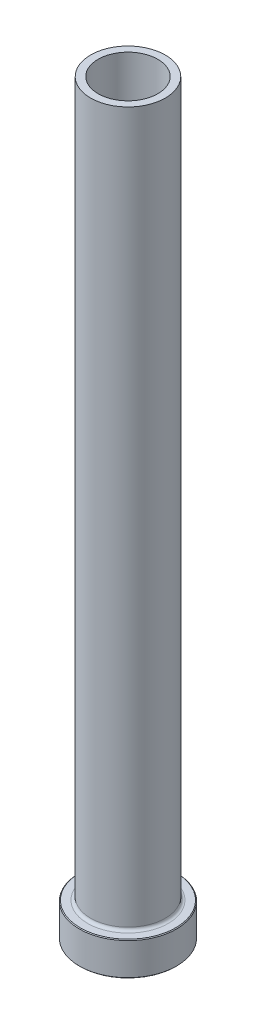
from build123d import *

# Parameters (mm, degrees)
FILLET1_R     = 0.8
CHAMFER1_SIZE = 0.2
CHAMFER3_SIZE = 0.5


with BuildPart() as part:
    # Sketch1 → Revolve1 (revolve)
    with BuildSketch(Plane.XY, mode=Mode.PRIVATE) as revolve1_sk:
        Polygon((-8, 200), (-10, 200), (-10, 9), (-13, 9), (-13, 0), (-8.25, 0), (-8.25, 133), (-8, 145), align=None)
    revolve(revolve1_sk.sketch.rotate(Axis((0, 92.187680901, 0), (0, -1, 0)), 270), axis=Axis((0, 92.187680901, 0), (0, -1, 0)))

    # Fillet1
    fillet1_edges = [part.edges().sort_by_distance(p)[0] for p in [
        (0, 9, -10),
    ]]
    fillet(fillet1_edges, radius=FILLET1_R)

    # Chamfer1
    chamfer1_edges = [part.edges().sort_by_distance(p)[0] for p in [
        (0, 0, -13),
        (0, 9, -13),
    ]]
    chamfer(chamfer1_edges, length=CHAMFER1_SIZE)

    # Chamfer3
    chamfer3_edges = [part.edges().sort_by_distance(p)[0] for p in [
        (0, 0, -8.25),
    ]]
    chamfer(chamfer3_edges, length=CHAMFER3_SIZE)


solid = part.part
